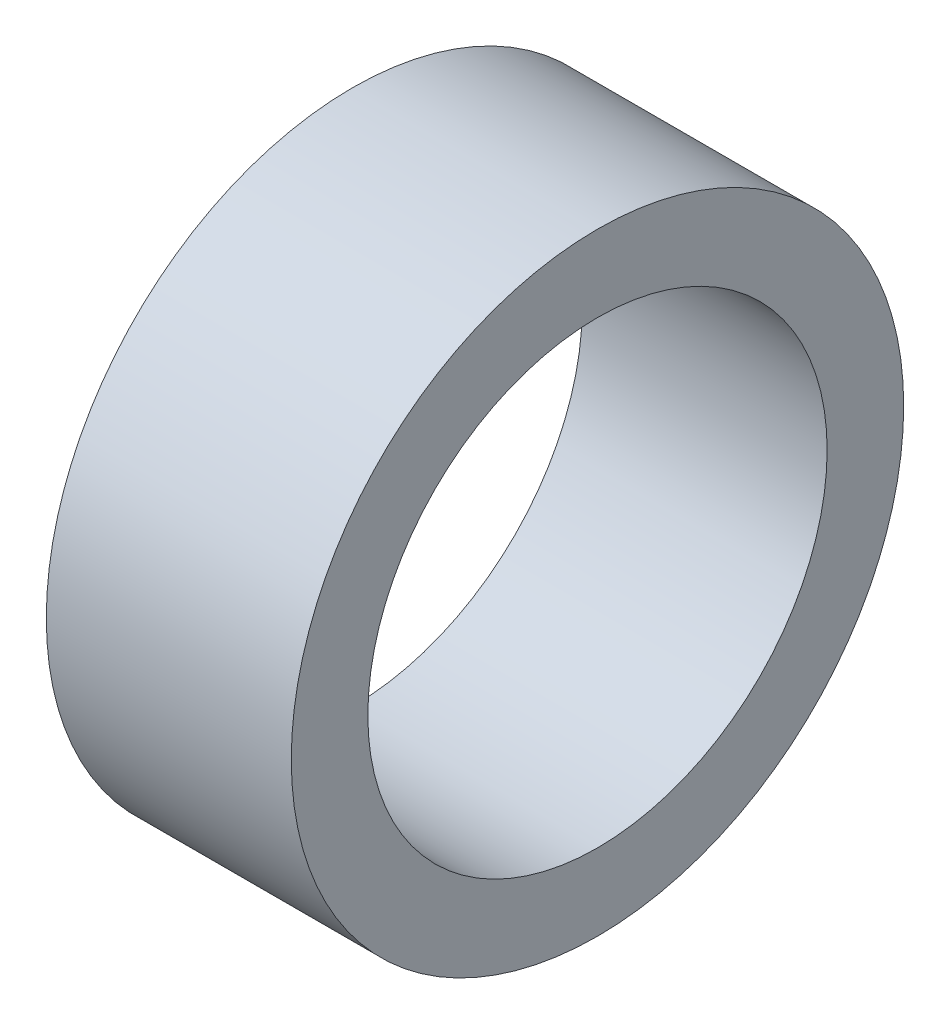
ISO-10303-21;
HEADER;
FILE_DESCRIPTION(('STEP AP214'),'2;1');
FILE_NAME('part.step','',(''),(''),'','','');
FILE_SCHEMA(('AUTOMOTIVE_DESIGN { 1 0 10303 214 1 1 1 1 }'));
ENDSEC;
DATA;
#1=APPLICATION_CONTEXT('core data for automotive mechanical design processes');
#2=APPLICATION_PROTOCOL_DEFINITION('international standard','automotive_design',2000,#1);
#3=PRODUCT_CONTEXT('',#1,'mechanical');
#4=PRODUCT('Part','Part','',(#3));
#5=PRODUCT_RELATED_PRODUCT_CATEGORY('part','',(#4));
#6=PRODUCT_DEFINITION_FORMATION('','',#4);
#7=PRODUCT_DEFINITION_CONTEXT('part definition',#1,'design');
#8=PRODUCT_DEFINITION('design','',#6,#7);
#9=PRODUCT_DEFINITION_SHAPE('','',#8);
#10=(LENGTH_UNIT() NAMED_UNIT(*) SI_UNIT(.MILLI.,.METRE.));
#11=(NAMED_UNIT(*) PLANE_ANGLE_UNIT() SI_UNIT($,.RADIAN.));
#12=(NAMED_UNIT(*) SI_UNIT($,.STERADIAN.) SOLID_ANGLE_UNIT());
#13=UNCERTAINTY_MEASURE_WITH_UNIT(LENGTH_MEASURE(1.E-05),#10,'distance_accuracy_value','');
#14=(GEOMETRIC_REPRESENTATION_CONTEXT(3) GLOBAL_UNCERTAINTY_ASSIGNED_CONTEXT((#13)) GLOBAL_UNIT_ASSIGNED_CONTEXT((#10,
#11,#12)) REPRESENTATION_CONTEXT('',''));
#15=CARTESIAN_POINT('',(0.,0.,0.));
#16=DIRECTION('',(0.,0.,1.));
#17=DIRECTION('',(1.,0.,0.));
#18=AXIS2_PLACEMENT_3D('',#15,#16,#17);
#19=CARTESIAN_POINT('',(0.,10.,0.));
#20=DIRECTION('',(1.,0.,0.));
#21=DIRECTION('',(0.,0.,-1.));
#22=AXIS2_PLACEMENT_3D('',#19,#20,#21);
#23=PLANE('',#22);
#24=CARTESIAN_POINT('',(0.,0.,0.));
#25=DIRECTION('',(-1.,0.,0.));
#26=DIRECTION('',(0.,0.,1.));
#27=AXIS2_PLACEMENT_3D('',#24,#25,#26);
#28=CIRCLE('',#27,7.5);
#29=CARTESIAN_POINT('',(0.,0.,7.5));
#30=VERTEX_POINT('',#29);
#31=EDGE_CURVE('E10',#30,#30,#28,.T.);
#32=ORIENTED_EDGE('',*,*,#31,.F.);
#33=EDGE_LOOP('',(#32));
#34=FACE_BOUND('',#33,.T.);
#35=CARTESIAN_POINT('',(0.,0.,0.));
#36=DIRECTION('',(-1.,0.,0.));
#37=DIRECTION('',(0.,0.,1.));
#38=AXIS2_PLACEMENT_3D('',#35,#36,#37);
#39=CIRCLE('',#38,10.);
#40=CARTESIAN_POINT('',(0.,0.,10.));
#41=VERTEX_POINT('',#40);
#42=EDGE_CURVE('E42',#41,#41,#39,.T.);
#43=ORIENTED_EDGE('',*,*,#42,.T.);
#44=EDGE_LOOP('',(#43));
#45=FACE_BOUND('',#44,.T.);
#46=ADVANCED_FACE('F28',(#34,#45),#23,.F.);
#47=CARTESIAN_POINT('',(0.,0.,0.));
#48=DIRECTION('',(-1.,0.,0.));
#49=DIRECTION('',(0.,0.,1.));
#50=AXIS2_PLACEMENT_3D('',#47,#48,#49);
#51=CYLINDRICAL_SURFACE('',#50,7.5);
#52=CARTESIAN_POINT('',(8.,0.,0.));
#53=DIRECTION('',(-1.,0.,0.));
#54=DIRECTION('',(0.,0.,1.));
#55=AXIS2_PLACEMENT_3D('',#52,#53,#54);
#56=CIRCLE('',#55,7.5);
#57=CARTESIAN_POINT('',(8.,0.,7.5));
#58=VERTEX_POINT('',#57);
#59=EDGE_CURVE('E34',#58,#58,#56,.T.);
#60=ORIENTED_EDGE('',*,*,#59,.F.);
#61=EDGE_LOOP('',(#60));
#62=FACE_BOUND('',#61,.T.);
#63=ORIENTED_EDGE('',*,*,#31,.T.);
#64=EDGE_LOOP('',(#63));
#65=FACE_BOUND('',#64,.T.);
#66=ADVANCED_FACE('F57',(#62,#65),#51,.F.);
#67=CARTESIAN_POINT('',(8.,10.,0.));
#68=DIRECTION('',(-1.,0.,0.));
#69=DIRECTION('',(0.,0.,1.));
#70=AXIS2_PLACEMENT_3D('',#67,#68,#69);
#71=PLANE('',#70);
#72=CARTESIAN_POINT('',(8.,0.,0.));
#73=DIRECTION('',(-1.,0.,0.));
#74=DIRECTION('',(0.,0.,1.));
#75=AXIS2_PLACEMENT_3D('',#72,#73,#74);
#76=CIRCLE('',#75,10.);
#77=CARTESIAN_POINT('',(8.,0.,10.));
#78=VERTEX_POINT('',#77);
#79=EDGE_CURVE('E38',#78,#78,#76,.T.);
#80=ORIENTED_EDGE('',*,*,#79,.F.);
#81=EDGE_LOOP('',(#80));
#82=FACE_BOUND('',#81,.T.);
#83=ORIENTED_EDGE('',*,*,#59,.T.);
#84=EDGE_LOOP('',(#83));
#85=FACE_BOUND('',#84,.T.);
#86=ADVANCED_FACE('F52',(#82,#85),#71,.F.);
#87=CARTESIAN_POINT('',(0.,0.,0.));
#88=DIRECTION('',(-1.,0.,0.));
#89=DIRECTION('',(0.,0.,1.));
#90=AXIS2_PLACEMENT_3D('',#87,#88,#89);
#91=CYLINDRICAL_SURFACE('',#90,10.);
#92=ORIENTED_EDGE('',*,*,#42,.F.);
#93=EDGE_LOOP('',(#92));
#94=FACE_BOUND('',#93,.T.);
#95=ORIENTED_EDGE('',*,*,#79,.T.);
#96=EDGE_LOOP('',(#95));
#97=FACE_BOUND('',#96,.T.);
#98=ADVANCED_FACE('F49',(#94,#97),#91,.T.);
#99=CLOSED_SHELL('',(#46,#66,#86,#98));
#100=MANIFOLD_SOLID_BREP('B2',#99);
#101=ADVANCED_BREP_SHAPE_REPRESENTATION('',(#18,#100),#14);
#102=SHAPE_DEFINITION_REPRESENTATION(#9,#101);
ENDSEC;
END-ISO-10303-21;
